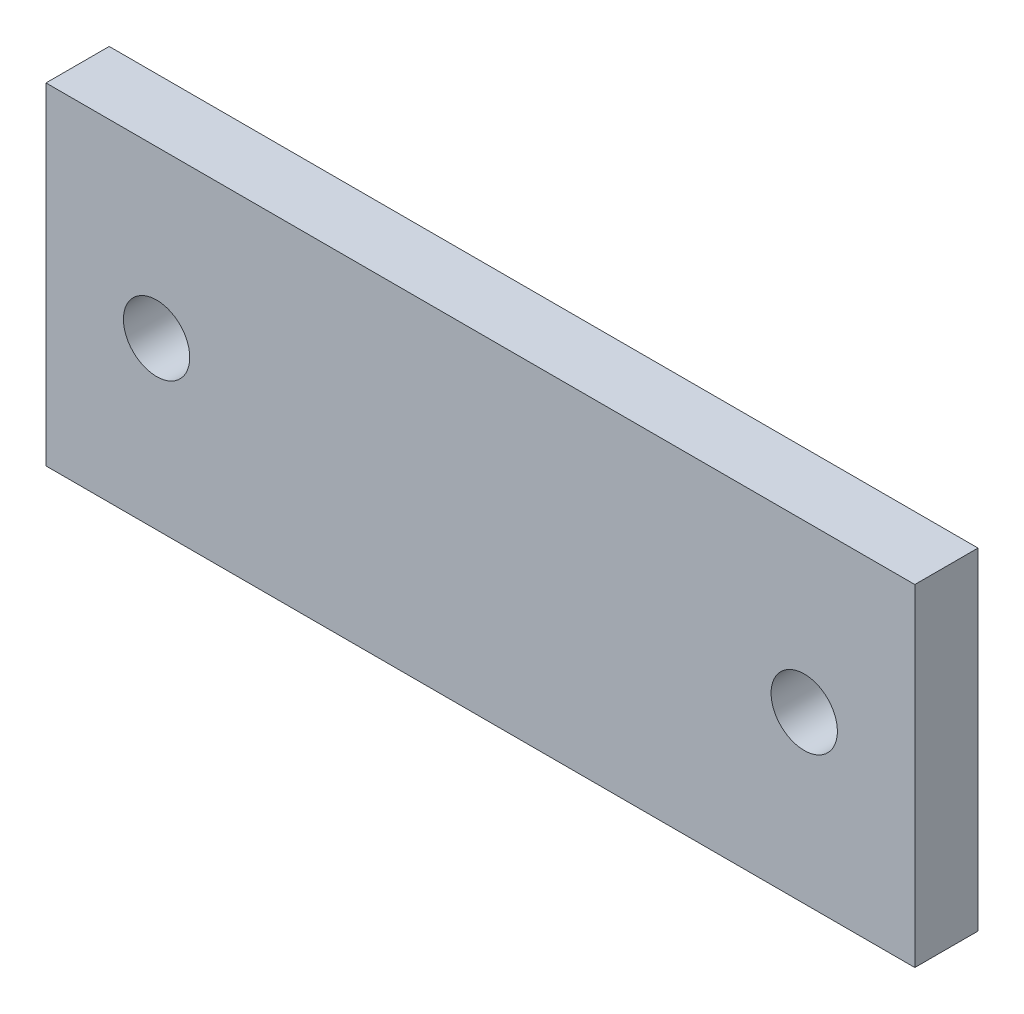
ISO-10303-21;
HEADER;
FILE_DESCRIPTION(('STEP AP214'),'2;1');
FILE_NAME('part.step','',(''),(''),'','','');
FILE_SCHEMA(('AUTOMOTIVE_DESIGN { 1 0 10303 214 1 1 1 1 }'));
ENDSEC;
DATA;
#1=APPLICATION_CONTEXT('core data for automotive mechanical design processes');
#2=APPLICATION_PROTOCOL_DEFINITION('international standard','automotive_design',2000,#1);
#3=PRODUCT_CONTEXT('',#1,'mechanical');
#4=PRODUCT('Part','Part','',(#3));
#5=PRODUCT_RELATED_PRODUCT_CATEGORY('part','',(#4));
#6=PRODUCT_DEFINITION_FORMATION('','',#4);
#7=PRODUCT_DEFINITION_CONTEXT('part definition',#1,'design');
#8=PRODUCT_DEFINITION('design','',#6,#7);
#9=PRODUCT_DEFINITION_SHAPE('','',#8);
#10=(LENGTH_UNIT() NAMED_UNIT(*) SI_UNIT(.MILLI.,.METRE.));
#11=(NAMED_UNIT(*) PLANE_ANGLE_UNIT() SI_UNIT($,.RADIAN.));
#12=(NAMED_UNIT(*) SI_UNIT($,.STERADIAN.) SOLID_ANGLE_UNIT());
#13=UNCERTAINTY_MEASURE_WITH_UNIT(LENGTH_MEASURE(1.E-05),#10,'distance_accuracy_value','');
#14=(GEOMETRIC_REPRESENTATION_CONTEXT(3) GLOBAL_UNCERTAINTY_ASSIGNED_CONTEXT((#13)) GLOBAL_UNIT_ASSIGNED_CONTEXT((#10,
#11,#12)) REPRESENTATION_CONTEXT('',''));
#15=CARTESIAN_POINT('',(0.,0.,0.));
#16=DIRECTION('',(0.,0.,1.));
#17=DIRECTION('',(1.,0.,0.));
#18=AXIS2_PLACEMENT_3D('',#15,#16,#17);
#19=CARTESIAN_POINT('',(-27.5000000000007,10.4999999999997,4.00000000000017));
#20=DIRECTION('',(1.,0.,0.));
#21=DIRECTION('',(0.,0.,-0.999999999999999));
#22=AXIS2_PLACEMENT_3D('',#19,#20,#21);
#23=PLANE('',#22);
#24=DIRECTION('',(0.,-1.,0.));
#25=VECTOR('',#24,1.);
#26=CARTESIAN_POINT('',(-27.5000000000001,10.4999999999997,1.66533453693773E-13));
#27=LINE('',#26,#25);
#28=CARTESIAN_POINT('',(-27.5000000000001,10.4999999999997,1.66533453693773E-13));
#29=VERTEX_POINT('',#28);
#30=CARTESIAN_POINT('',(-27.4999999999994,-10.5000000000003,1.11022302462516E-13));
#31=VERTEX_POINT('',#30);
#32=EDGE_CURVE('E85',#29,#31,#27,.T.);
#33=ORIENTED_EDGE('',*,*,#32,.T.);
#34=DIRECTION('',(0.,0.,-0.999999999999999));
#35=VECTOR('',#34,1.);
#36=CARTESIAN_POINT('',(-27.4999999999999,-10.5000000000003,4.00000000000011));
#37=LINE('',#36,#35);
#38=CARTESIAN_POINT('',(-27.4999999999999,-10.5000000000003,4.00000000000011));
#39=VERTEX_POINT('',#38);
#40=EDGE_CURVE('E11',#39,#31,#37,.T.);
#41=ORIENTED_EDGE('',*,*,#40,.F.);
#42=DIRECTION('',(0.,-1.,0.));
#43=VECTOR('',#42,1.);
#44=CARTESIAN_POINT('',(-27.5000000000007,10.4999999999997,4.00000000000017));
#45=LINE('',#44,#43);
#46=CARTESIAN_POINT('',(-27.5000000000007,10.4999999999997,4.00000000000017));
#47=VERTEX_POINT('',#46);
#48=EDGE_CURVE('E115',#47,#39,#45,.T.);
#49=ORIENTED_EDGE('',*,*,#48,.F.);
#50=DIRECTION('',(0.,0.,-0.999999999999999));
#51=VECTOR('',#50,1.);
#52=CARTESIAN_POINT('',(-27.5000000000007,10.4999999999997,4.00000000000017));
#53=LINE('',#52,#51);
#54=EDGE_CURVE('E98',#47,#29,#53,.T.);
#55=ORIENTED_EDGE('',*,*,#54,.T.);
#56=EDGE_LOOP('',(#33,#41,#49,#55));
#57=FACE_BOUND('',#56,.T.);
#58=ADVANCED_FACE('F40',(#57),#23,.F.);
#59=CARTESIAN_POINT('',(-27.4999999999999,-10.5000000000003,4.00000000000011));
#60=DIRECTION('',(0.,1.,0.));
#61=DIRECTION('',(-1.,0.,0.));
#62=AXIS2_PLACEMENT_3D('',#59,#60,#61);
#63=PLANE('',#62);
#64=DIRECTION('',(1.,0.,0.));
#65=VECTOR('',#64,1.);
#66=CARTESIAN_POINT('',(-27.4999999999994,-10.5000000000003,1.11022302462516E-13));
#67=LINE('',#66,#65);
#68=CARTESIAN_POINT('',(27.4999999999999,-10.4999999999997,9.43689570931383E-13));
#69=VERTEX_POINT('',#68);
#70=EDGE_CURVE('E81',#31,#69,#67,.T.);
#71=ORIENTED_EDGE('',*,*,#70,.T.);
#72=DIRECTION('',(0.,0.,-0.999999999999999));
#73=VECTOR('',#72,1.);
#74=CARTESIAN_POINT('',(27.4999999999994,-10.4999999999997,4.00000000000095));
#75=LINE('',#74,#73);
#76=CARTESIAN_POINT('',(27.4999999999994,-10.4999999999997,4.00000000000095));
#77=VERTEX_POINT('',#76);
#78=EDGE_CURVE('E48',#77,#69,#75,.T.);
#79=ORIENTED_EDGE('',*,*,#78,.F.);
#80=DIRECTION('',(1.,0.,0.));
#81=VECTOR('',#80,1.);
#82=CARTESIAN_POINT('',(-27.4999999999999,-10.5000000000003,4.00000000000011));
#83=LINE('',#82,#81);
#84=EDGE_CURVE('E94',#39,#77,#83,.T.);
#85=ORIENTED_EDGE('',*,*,#84,.F.);
#86=ORIENTED_EDGE('',*,*,#40,.T.);
#87=EDGE_LOOP('',(#71,#79,#85,#86));
#88=FACE_BOUND('',#87,.T.);
#89=ADVANCED_FACE('F93',(#88),#63,.F.);
#90=CARTESIAN_POINT('',(27.4999999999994,10.5000000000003,4.00000000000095));
#91=DIRECTION('',(-1.,0.,0.));
#92=DIRECTION('',(0.,-1.,0.));
#93=AXIS2_PLACEMENT_3D('',#90,#91,#92);
#94=PLANE('',#93);
#95=DIRECTION('',(0.,1.,0.));
#96=VECTOR('',#95,1.);
#97=CARTESIAN_POINT('',(27.4999999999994,10.5000000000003,9.43689570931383E-13));
#98=LINE('',#97,#96);
#99=CARTESIAN_POINT('',(27.4999999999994,10.5000000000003,9.43689570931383E-13));
#100=VERTEX_POINT('',#99);
#101=EDGE_CURVE('E86',#69,#100,#98,.T.);
#102=ORIENTED_EDGE('',*,*,#101,.T.);
#103=DIRECTION('',(0.,0.,-0.999999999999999));
#104=VECTOR('',#103,1.);
#105=CARTESIAN_POINT('',(27.4999999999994,10.5000000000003,4.00000000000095));
#106=LINE('',#105,#104);
#107=CARTESIAN_POINT('',(27.4999999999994,10.5000000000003,4.00000000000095));
#108=VERTEX_POINT('',#107);
#109=EDGE_CURVE('E126',#108,#100,#106,.T.);
#110=ORIENTED_EDGE('',*,*,#109,.F.);
#111=DIRECTION('',(0.,1.,0.));
#112=VECTOR('',#111,1.);
#113=CARTESIAN_POINT('',(27.4999999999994,10.5000000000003,4.00000000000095));
#114=LINE('',#113,#112);
#115=EDGE_CURVE('E60',#77,#108,#114,.T.);
#116=ORIENTED_EDGE('',*,*,#115,.F.);
#117=ORIENTED_EDGE('',*,*,#78,.T.);
#118=EDGE_LOOP('',(#102,#110,#116,#117));
#119=FACE_BOUND('',#118,.T.);
#120=ADVANCED_FACE('F130',(#119),#94,.F.);
#121=CARTESIAN_POINT('',(-27.5000000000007,10.4999999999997,4.00000000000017));
#122=DIRECTION('',(0.,-1.,0.));
#123=DIRECTION('',(1.,0.,0.));
#124=AXIS2_PLACEMENT_3D('',#121,#122,#123);
#125=PLANE('',#124);
#126=DIRECTION('',(-1.,0.,0.));
#127=VECTOR('',#126,1.);
#128=CARTESIAN_POINT('',(-27.5000000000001,10.4999999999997,1.66533453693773E-13));
#129=LINE('',#128,#127);
#130=EDGE_CURVE('E112',#100,#29,#129,.T.);
#131=ORIENTED_EDGE('',*,*,#130,.T.);
#132=ORIENTED_EDGE('',*,*,#54,.F.);
#133=DIRECTION('',(-1.,0.,0.));
#134=VECTOR('',#133,1.);
#135=CARTESIAN_POINT('',(-27.5000000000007,10.4999999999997,4.00000000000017));
#136=LINE('',#135,#134);
#137=EDGE_CURVE('E55',#108,#47,#136,.T.);
#138=ORIENTED_EDGE('',*,*,#137,.F.);
#139=ORIENTED_EDGE('',*,*,#109,.T.);
#140=EDGE_LOOP('',(#131,#132,#138,#139));
#141=FACE_BOUND('',#140,.T.);
#142=ADVANCED_FACE('F132',(#141),#125,.F.);
#143=CARTESIAN_POINT('',(-27.4999999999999,-10.5000000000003,4.00000000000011));
#144=DIRECTION('',(0.,0.,0.999999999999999));
#145=DIRECTION('',(1.,0.,0.));
#146=AXIS2_PLACEMENT_3D('',#143,#144,#145);
#147=PLANE('',#146);
#148=CARTESIAN_POINT('',(-20.5000000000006,-2.22044604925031E-13,4.00000000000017));
#149=DIRECTION('',(0.,0.,0.999999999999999));
#150=DIRECTION('',(1.,0.,0.));
#151=AXIS2_PLACEMENT_3D('',#148,#149,#150);
#152=CIRCLE('',#151,2.1);
#153=CARTESIAN_POINT('',(-18.4000000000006,-2.22044604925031E-13,4.00000000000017));
#154=VERTEX_POINT('',#153);
#155=EDGE_CURVE('E221',#154,#154,#152,.T.);
#156=ORIENTED_EDGE('',*,*,#155,.F.);
#157=EDGE_LOOP('',(#156));
#158=FACE_BOUND('',#157,.T.);
#159=CARTESIAN_POINT('',(20.4999999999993,0.,4.00000000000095));
#160=DIRECTION('',(0.,0.,0.999999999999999));
#161=DIRECTION('',(1.,0.,0.));
#162=AXIS2_PLACEMENT_3D('',#159,#160,#161);
#163=CIRCLE('',#162,2.1);
#164=CARTESIAN_POINT('',(22.5999999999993,0.,4.00000000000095));
#165=VERTEX_POINT('',#164);
#166=EDGE_CURVE('E100',#165,#165,#163,.T.);
#167=ORIENTED_EDGE('',*,*,#166,.F.);
#168=EDGE_LOOP('',(#167));
#169=FACE_BOUND('',#168,.T.);
#170=ORIENTED_EDGE('',*,*,#48,.T.);
#171=ORIENTED_EDGE('',*,*,#84,.T.);
#172=ORIENTED_EDGE('',*,*,#115,.T.);
#173=ORIENTED_EDGE('',*,*,#137,.T.);
#174=EDGE_LOOP('',(#170,#171,#172,#173));
#175=FACE_BOUND('',#174,.T.);
#176=ADVANCED_FACE('F133',(#158,#169,#175),#147,.T.);
#177=CARTESIAN_POINT('',(-27.4999999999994,-10.5000000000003,1.11022302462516E-13));
#178=DIRECTION('',(0.,0.,0.999999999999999));
#179=DIRECTION('',(1.,0.,0.));
#180=AXIS2_PLACEMENT_3D('',#177,#178,#179);
#181=PLANE('',#180);
#182=CARTESIAN_POINT('',(-20.5,-2.22044604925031E-13,1.66533453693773E-13));
#183=DIRECTION('',(0.,0.,0.999999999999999));
#184=DIRECTION('',(1.,0.,0.));
#185=AXIS2_PLACEMENT_3D('',#182,#183,#184);
#186=CIRCLE('',#185,2.1);
#187=CARTESIAN_POINT('',(-18.4000000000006,-2.23376872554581E-13,1.67400815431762E-13));
#188=VERTEX_POINT('',#187);
#189=EDGE_CURVE('E219',#188,#188,#186,.T.);
#190=ORIENTED_EDGE('',*,*,#189,.T.);
#191=EDGE_LOOP('',(#190));
#192=FACE_BOUND('',#191,.T.);
#193=CARTESIAN_POINT('',(20.4999999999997,0.,9.43689570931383E-13));
#194=DIRECTION('',(0.,0.,0.999999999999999));
#195=DIRECTION('',(1.,0.,0.));
#196=AXIS2_PLACEMENT_3D('',#193,#194,#195);
#197=CIRCLE('',#196,2.1);
#198=CARTESIAN_POINT('',(22.5999999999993,0.,9.44556932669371E-13));
#199=VERTEX_POINT('',#198);
#200=EDGE_CURVE('E106',#199,#199,#197,.T.);
#201=ORIENTED_EDGE('',*,*,#200,.T.);
#202=EDGE_LOOP('',(#201));
#203=FACE_BOUND('',#202,.T.);
#204=ORIENTED_EDGE('',*,*,#32,.F.);
#205=ORIENTED_EDGE('',*,*,#130,.F.);
#206=ORIENTED_EDGE('',*,*,#101,.F.);
#207=ORIENTED_EDGE('',*,*,#70,.F.);
#208=EDGE_LOOP('',(#204,#205,#206,#207));
#209=FACE_BOUND('',#208,.T.);
#210=ADVANCED_FACE('F82',(#192,#203,#209),#181,.F.);
#211=CARTESIAN_POINT('',(20.4999999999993,0.,4.00000000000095));
#212=DIRECTION('',(0.,0.,0.999999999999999));
#213=DIRECTION('',(1.,0.,0.));
#214=AXIS2_PLACEMENT_3D('',#211,#212,#213);
#215=CYLINDRICAL_SURFACE('',#214,2.1);
#216=CARTESIAN_POINT('',(22.5999999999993,0.,9.44556932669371E-13));
#217=CARTESIAN_POINT('',(22.5999999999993,0.,0.0416666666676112));
#218=CARTESIAN_POINT('',(22.5999999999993,0.,0.083333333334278));
#219=CARTESIAN_POINT('',(22.5999999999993,0.,0.166666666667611));
#220=CARTESIAN_POINT('',(22.5999999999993,0.,0.208333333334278));
#221=CARTESIAN_POINT('',(22.5999999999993,0.,0.291666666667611));
#222=CARTESIAN_POINT('',(22.5999999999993,0.,0.333333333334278));
#223=CARTESIAN_POINT('',(22.5999999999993,0.,0.416666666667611));
#224=CARTESIAN_POINT('',(22.5999999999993,0.,0.458333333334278));
#225=CARTESIAN_POINT('',(22.5999999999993,0.,0.541666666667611));
#226=CARTESIAN_POINT('',(22.5999999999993,0.,0.583333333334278));
#227=CARTESIAN_POINT('',(22.5999999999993,0.,0.666666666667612));
#228=CARTESIAN_POINT('',(22.5999999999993,0.,0.708333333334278));
#229=CARTESIAN_POINT('',(22.5999999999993,0.,0.791666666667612));
#230=CARTESIAN_POINT('',(22.5999999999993,0.,0.833333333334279));
#231=CARTESIAN_POINT('',(22.5999999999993,0.,0.916666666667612));
#232=CARTESIAN_POINT('',(22.5999999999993,0.,0.958333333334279));
#233=CARTESIAN_POINT('',(22.5999999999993,0.,1.04166666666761));
#234=CARTESIAN_POINT('',(22.5999999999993,0.,1.08333333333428));
#235=CARTESIAN_POINT('',(22.5999999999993,0.,1.16666666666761));
#236=CARTESIAN_POINT('',(22.5999999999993,0.,1.20833333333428));
#237=CARTESIAN_POINT('',(22.5999999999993,0.,1.29166666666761));
#238=CARTESIAN_POINT('',(22.5999999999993,0.,1.33333333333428));
#239=CARTESIAN_POINT('',(22.5999999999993,0.,1.41666666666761));
#240=CARTESIAN_POINT('',(22.5999999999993,0.,1.45833333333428));
#241=CARTESIAN_POINT('',(22.5999999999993,0.,1.54166666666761));
#242=CARTESIAN_POINT('',(22.5999999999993,0.,1.58333333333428));
#243=CARTESIAN_POINT('',(22.5999999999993,0.,1.66666666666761));
#244=CARTESIAN_POINT('',(22.5999999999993,0.,1.70833333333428));
#245=CARTESIAN_POINT('',(22.5999999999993,0.,1.79166666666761));
#246=CARTESIAN_POINT('',(22.5999999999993,0.,1.83333333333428));
#247=CARTESIAN_POINT('',(22.5999999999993,0.,1.91666666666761));
#248=CARTESIAN_POINT('',(22.5999999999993,0.,1.95833333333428));
#249=CARTESIAN_POINT('',(22.5999999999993,0.,2.04166666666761));
#250=CARTESIAN_POINT('',(22.5999999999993,0.,2.08333333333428));
#251=CARTESIAN_POINT('',(22.5999999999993,0.,2.16666666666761));
#252=CARTESIAN_POINT('',(22.5999999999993,0.,2.20833333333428));
#253=CARTESIAN_POINT('',(22.5999999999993,0.,2.29166666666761));
#254=CARTESIAN_POINT('',(22.5999999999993,0.,2.33333333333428));
#255=CARTESIAN_POINT('',(22.5999999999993,0.,2.41666666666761));
#256=CARTESIAN_POINT('',(22.5999999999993,0.,2.45833333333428));
#257=CARTESIAN_POINT('',(22.5999999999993,0.,2.54166666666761));
#258=CARTESIAN_POINT('',(22.5999999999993,0.,2.58333333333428));
#259=CARTESIAN_POINT('',(22.5999999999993,0.,2.66666666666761));
#260=CARTESIAN_POINT('',(22.5999999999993,0.,2.70833333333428));
#261=CARTESIAN_POINT('',(22.5999999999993,0.,2.79166666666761));
#262=CARTESIAN_POINT('',(22.5999999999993,0.,2.83333333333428));
#263=CARTESIAN_POINT('',(22.5999999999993,0.,2.91666666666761));
#264=CARTESIAN_POINT('',(22.5999999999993,0.,2.95833333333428));
#265=CARTESIAN_POINT('',(22.5999999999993,0.,3.04166666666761));
#266=CARTESIAN_POINT('',(22.5999999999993,0.,3.08333333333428));
#267=CARTESIAN_POINT('',(22.5999999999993,0.,3.16666666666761));
#268=CARTESIAN_POINT('',(22.5999999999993,0.,3.20833333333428));
#269=CARTESIAN_POINT('',(22.5999999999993,0.,3.29166666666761));
#270=CARTESIAN_POINT('',(22.5999999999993,0.,3.33333333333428));
#271=CARTESIAN_POINT('',(22.5999999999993,0.,3.41666666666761));
#272=CARTESIAN_POINT('',(22.5999999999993,0.,3.45833333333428));
#273=CARTESIAN_POINT('',(22.5999999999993,0.,3.54166666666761));
#274=CARTESIAN_POINT('',(22.5999999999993,0.,3.58333333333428));
#275=CARTESIAN_POINT('',(22.5999999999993,0.,3.66666666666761));
#276=CARTESIAN_POINT('',(22.5999999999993,0.,3.70833333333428));
#277=CARTESIAN_POINT('',(22.5999999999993,0.,3.79166666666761));
#278=CARTESIAN_POINT('',(22.5999999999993,0.,3.83333333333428));
#279=CARTESIAN_POINT('',(22.5999999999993,0.,3.91666666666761));
#280=CARTESIAN_POINT('',(22.5999999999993,0.,3.95833333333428));
#281=CARTESIAN_POINT('',(22.5999999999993,0.,4.00000000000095));
#282=B_SPLINE_CURVE_WITH_KNOTS('',3,(#216,#217,#218,#219,#220,#221,#222,#223,#224,#225,#226,
#227,#228,#229,#230,#231,#232,#233,#234,#235,#236,#237,#238,#239,#240,#241,#242,#243,#244,#245,
#246,#247,#248,#249,#250,#251,#252,#253,#254,#255,#256,#257,#258,#259,#260,#261,#262,#263,#264,
#265,#266,#267,#268,#269,#270,#271,#272,#273,#274,#275,#276,#277,#278,#279,#280,#281),
.UNSPECIFIED.,.F.,.F.,(4,2,2,2,2,2,2,2,2,2,2,2,2,2,2,2,2,2,2,2,2,2,2,2,2,2,2,2,2,2,2,2,4),(0.,
0.125,0.25,0.375,0.5,0.625,0.750000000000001,0.875000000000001,1.,1.125,1.25,1.375,1.5,1.625,
1.75,1.875,2.,2.125,2.25,2.375,2.5,2.625,2.75,2.875,3.,3.125,3.25,3.375,3.5,3.625,3.75,3.875,
4.),.UNSPECIFIED.);
#283=EDGE_CURVE('BSEAM141',#199,#165,#282,.T.);
#284=ORIENTED_EDGE('',*,*,#200,.F.);
#285=ORIENTED_EDGE('',*,*,#166,.T.);
#286=ORIENTED_EDGE('',*,*,#283,.T.);
#287=ORIENTED_EDGE('',*,*,#283,.F.);
#288=EDGE_LOOP('',(#284,#286,#285,#287));
#289=FACE_BOUND('',#288,.T.);
#290=ADVANCED_FACE('F141',(#289),#215,.F.);
#291=CARTESIAN_POINT('',(-20.5000000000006,-2.22044604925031E-13,4.00000000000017));
#292=DIRECTION('',(0.,0.,0.999999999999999));
#293=DIRECTION('',(1.,0.,0.));
#294=AXIS2_PLACEMENT_3D('',#291,#292,#293);
#295=CYLINDRICAL_SURFACE('',#294,2.1);
#296=CARTESIAN_POINT('',(-18.4000000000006,-2.23376872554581E-13,1.67400815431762E-13));
#297=CARTESIAN_POINT('',(-18.4000000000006,-2.23362994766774E-13,0.0416666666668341));
#298=CARTESIAN_POINT('',(-18.4000000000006,-2.23349116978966E-13,0.0833333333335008));
#299=CARTESIAN_POINT('',(-18.4000000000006,-2.2332136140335E-13,0.166666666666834));
#300=CARTESIAN_POINT('',(-18.4000000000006,-2.23307483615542E-13,0.208333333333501));
#301=CARTESIAN_POINT('',(-18.4000000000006,-2.23279728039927E-13,0.291666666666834));
#302=CARTESIAN_POINT('',(-18.4000000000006,-2.23265850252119E-13,0.333333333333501));
#303=CARTESIAN_POINT('',(-18.4000000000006,-2.23238094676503E-13,0.416666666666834));
#304=CARTESIAN_POINT('',(-18.4000000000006,-2.23224216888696E-13,0.458333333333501));
#305=CARTESIAN_POINT('',(-18.4000000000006,-2.2319646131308E-13,0.541666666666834));
#306=CARTESIAN_POINT('',(-18.4000000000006,-2.23182583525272E-13,0.583333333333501));
#307=CARTESIAN_POINT('',(-18.4000000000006,-2.23154827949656E-13,0.666666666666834));
#308=CARTESIAN_POINT('',(-18.4000000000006,-2.23140950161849E-13,0.708333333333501));
#309=CARTESIAN_POINT('',(-18.4000000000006,-2.23113194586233E-13,0.791666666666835));
#310=CARTESIAN_POINT('',(-18.4000000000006,-2.23099316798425E-13,0.833333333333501));
#311=CARTESIAN_POINT('',(-18.4000000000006,-2.2307156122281E-13,0.916666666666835));
#312=CARTESIAN_POINT('',(-18.4000000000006,-2.23057683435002E-13,0.958333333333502));
#313=CARTESIAN_POINT('',(-18.4000000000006,-2.23029927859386E-13,1.04166666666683));
#314=CARTESIAN_POINT('',(-18.4000000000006,-2.23016050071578E-13,1.0833333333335));
#315=CARTESIAN_POINT('',(-18.4000000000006,-2.22988294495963E-13,1.16666666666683));
#316=CARTESIAN_POINT('',(-18.4000000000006,-2.22974416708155E-13,1.2083333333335));
#317=CARTESIAN_POINT('',(-18.4000000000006,-2.22946661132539E-13,1.29166666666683));
#318=CARTESIAN_POINT('',(-18.4000000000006,-2.22932783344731E-13,1.3333333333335));
#319=CARTESIAN_POINT('',(-18.4000000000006,-2.22905027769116E-13,1.41666666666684));
#320=CARTESIAN_POINT('',(-18.4000000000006,-2.22891149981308E-13,1.4583333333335));
#321=CARTESIAN_POINT('',(-18.4000000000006,-2.22863394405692E-13,1.54166666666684));
#322=CARTESIAN_POINT('',(-18.4000000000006,-2.22849516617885E-13,1.5833333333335));
#323=CARTESIAN_POINT('',(-18.4000000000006,-2.22821761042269E-13,1.66666666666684));
#324=CARTESIAN_POINT('',(-18.4000000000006,-2.22807883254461E-13,1.7083333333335));
#325=CARTESIAN_POINT('',(-18.4000000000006,-2.22780127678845E-13,1.79166666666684));
#326=CARTESIAN_POINT('',(-18.4000000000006,-2.22766249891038E-13,1.8333333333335));
#327=CARTESIAN_POINT('',(-18.4000000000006,-2.22738494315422E-13,1.91666666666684));
#328=CARTESIAN_POINT('',(-18.4000000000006,-2.22724616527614E-13,1.9583333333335));
#329=CARTESIAN_POINT('',(-18.4000000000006,-2.22696860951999E-13,2.04166666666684));
#330=CARTESIAN_POINT('',(-18.4000000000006,-2.22682983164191E-13,2.0833333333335));
#331=CARTESIAN_POINT('',(-18.4000000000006,-2.22655227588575E-13,2.16666666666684));
#332=CARTESIAN_POINT('',(-18.4000000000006,-2.22641349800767E-13,2.2083333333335));
#333=CARTESIAN_POINT('',(-18.4000000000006,-2.22613594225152E-13,2.29166666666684));
#334=CARTESIAN_POINT('',(-18.4000000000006,-2.22599716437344E-13,2.3333333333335));
#335=CARTESIAN_POINT('',(-18.4000000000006,-2.22571960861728E-13,2.41666666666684));
#336=CARTESIAN_POINT('',(-18.4000000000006,-2.2255808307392E-13,2.4583333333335));
#337=CARTESIAN_POINT('',(-18.4000000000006,-2.22530327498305E-13,2.54166666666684));
#338=CARTESIAN_POINT('',(-18.4000000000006,-2.22516449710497E-13,2.5833333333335));
#339=CARTESIAN_POINT('',(-18.4000000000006,-2.22488694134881E-13,2.66666666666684));
#340=CARTESIAN_POINT('',(-18.4000000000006,-2.22474816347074E-13,2.7083333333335));
#341=CARTESIAN_POINT('',(-18.4000000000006,-2.22447060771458E-13,2.79166666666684));
#342=CARTESIAN_POINT('',(-18.4000000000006,-2.2243318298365E-13,2.8333333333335));
#343=CARTESIAN_POINT('',(-18.4000000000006,-2.22405427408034E-13,2.91666666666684));
#344=CARTESIAN_POINT('',(-18.4000000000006,-2.22391549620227E-13,2.9583333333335));
#345=CARTESIAN_POINT('',(-18.4000000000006,-2.22363794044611E-13,3.04166666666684));
#346=CARTESIAN_POINT('',(-18.4000000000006,-2.22349916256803E-13,3.0833333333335));
#347=CARTESIAN_POINT('',(-18.4000000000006,-2.22322160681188E-13,3.16666666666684));
#348=CARTESIAN_POINT('',(-18.4000000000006,-2.2230828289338E-13,3.2083333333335));
#349=CARTESIAN_POINT('',(-18.4000000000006,-2.22280527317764E-13,3.29166666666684));
#350=CARTESIAN_POINT('',(-18.4000000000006,-2.22266649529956E-13,3.3333333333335));
#351=CARTESIAN_POINT('',(-18.4000000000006,-2.22238893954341E-13,3.41666666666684));
#352=CARTESIAN_POINT('',(-18.4000000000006,-2.22225016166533E-13,3.4583333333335));
#353=CARTESIAN_POINT('',(-18.4000000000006,-2.22197260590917E-13,3.54166666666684));
#354=CARTESIAN_POINT('',(-18.4000000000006,-2.22183382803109E-13,3.5833333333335));
#355=CARTESIAN_POINT('',(-18.4000000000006,-2.22155627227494E-13,3.66666666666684));
#356=CARTESIAN_POINT('',(-18.4000000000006,-2.22141749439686E-13,3.7083333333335));
#357=CARTESIAN_POINT('',(-18.4000000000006,-2.2211399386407E-13,3.79166666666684));
#358=CARTESIAN_POINT('',(-18.4000000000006,-2.22100116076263E-13,3.8333333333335));
#359=CARTESIAN_POINT('',(-18.4000000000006,-2.22072360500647E-13,3.91666666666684));
#360=CARTESIAN_POINT('',(-18.4000000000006,-2.22058482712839E-13,3.9583333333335));
#361=CARTESIAN_POINT('',(-18.4000000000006,-2.22044604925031E-13,4.00000000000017));
#362=B_SPLINE_CURVE_WITH_KNOTS('',3,(#296,#297,#298,#299,#300,#301,#302,#303,#304,#305,#306,
#307,#308,#309,#310,#311,#312,#313,#314,#315,#316,#317,#318,#319,#320,#321,#322,#323,#324,#325,
#326,#327,#328,#329,#330,#331,#332,#333,#334,#335,#336,#337,#338,#339,#340,#341,#342,#343,#344,
#345,#346,#347,#348,#349,#350,#351,#352,#353,#354,#355,#356,#357,#358,#359,#360,#361),
.UNSPECIFIED.,.F.,.F.,(4,2,2,2,2,2,2,2,2,2,2,2,2,2,2,2,2,2,2,2,2,2,2,2,2,2,2,2,2,2,2,2,4),(0.,
0.125,0.25,0.375,0.5,0.625,0.750000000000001,0.875000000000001,1.,1.125,1.25,1.375,1.5,1.625,
1.75,1.875,2.,2.125,2.25,2.375,2.5,2.625,2.75,2.875,3.,3.125,3.25,3.375,3.5,3.625,3.75,3.875,
4.),.UNSPECIFIED.);
#363=EDGE_CURVE('BSEAM178',#188,#154,#362,.T.);
#364=ORIENTED_EDGE('',*,*,#189,.F.);
#365=ORIENTED_EDGE('',*,*,#155,.T.);
#366=ORIENTED_EDGE('',*,*,#363,.T.);
#367=ORIENTED_EDGE('',*,*,#363,.F.);
#368=EDGE_LOOP('',(#364,#366,#365,#367));
#369=FACE_BOUND('',#368,.T.);
#370=ADVANCED_FACE('F178',(#369),#295,.F.);
#371=CLOSED_SHELL('',(#58,#89,#120,#142,#176,#210,#290,#370));
#372=MANIFOLD_SOLID_BREP('B2',#371);
#373=ADVANCED_BREP_SHAPE_REPRESENTATION('',(#18,#372),#14);
#374=SHAPE_DEFINITION_REPRESENTATION(#9,#373);
ENDSEC;
END-ISO-10303-21;
